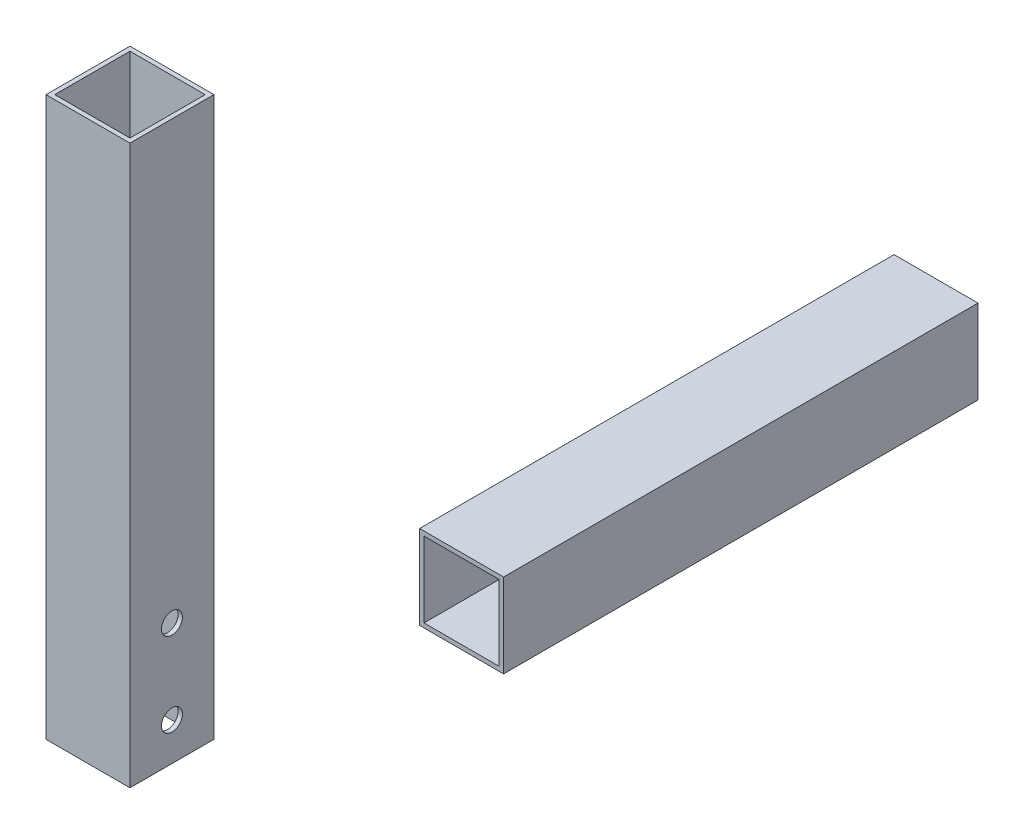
ISO-10303-21;
HEADER;
FILE_DESCRIPTION(('STEP AP214'),'2;1');
FILE_NAME('part.step','',(''),(''),'','','');
FILE_SCHEMA(('AUTOMOTIVE_DESIGN { 1 0 10303 214 1 1 1 1 }'));
ENDSEC;
DATA;
#1=APPLICATION_CONTEXT('core data for automotive mechanical design processes');
#2=APPLICATION_PROTOCOL_DEFINITION('international standard','automotive_design',2000,#1);
#3=PRODUCT_CONTEXT('',#1,'mechanical');
#4=PRODUCT('Part','Part','',(#3));
#5=PRODUCT_RELATED_PRODUCT_CATEGORY('part','',(#4));
#6=PRODUCT_DEFINITION_FORMATION('','',#4);
#7=PRODUCT_DEFINITION_CONTEXT('part definition',#1,'design');
#8=PRODUCT_DEFINITION('design','',#6,#7);
#9=PRODUCT_DEFINITION_SHAPE('','',#8);
#10=(LENGTH_UNIT() NAMED_UNIT(*) SI_UNIT(.MILLI.,.METRE.));
#11=(NAMED_UNIT(*) PLANE_ANGLE_UNIT() SI_UNIT($,.RADIAN.));
#12=(NAMED_UNIT(*) SI_UNIT($,.STERADIAN.) SOLID_ANGLE_UNIT());
#13=UNCERTAINTY_MEASURE_WITH_UNIT(LENGTH_MEASURE(1.E-05),#10,'distance_accuracy_value','');
#14=(GEOMETRIC_REPRESENTATION_CONTEXT(3) GLOBAL_UNCERTAINTY_ASSIGNED_CONTEXT((#13)) GLOBAL_UNIT_ASSIGNED_CONTEXT((#10,
#11,#12)) REPRESENTATION_CONTEXT('',''));
#15=CARTESIAN_POINT('',(0.,0.,0.));
#16=DIRECTION('',(0.,0.,1.));
#17=DIRECTION('',(1.,0.,0.));
#18=AXIS2_PLACEMENT_3D('',#15,#16,#17);
#19=CARTESIAN_POINT('',(-21.59,31.75,0.));
#20=DIRECTION('',(1.,0.,0.));
#21=DIRECTION('',(0.,0.,1.));
#22=AXIS2_PLACEMENT_3D('',#19,#20,#21);
#23=CYLINDRICAL_SURFACE('',#22,3.96875);
#24=DIRECTION('',(1.,0.,0.));
#25=VECTOR('',#24,1.);
#26=CARTESIAN_POINT('',(-21.59,31.75,3.96875));
#27=LINE('',#26,#25);
#28=CARTESIAN_POINT('',(14.224,31.75,3.96875));
#29=VERTEX_POINT('',#28);
#30=CARTESIAN_POINT('',(15.875,31.75,3.96875));
#31=VERTEX_POINT('',#30);
#32=EDGE_CURVE('P0_E11',#29,#31,#27,.T.);
#33=ORIENTED_EDGE('',*,*,#32,.F.);
#34=CARTESIAN_POINT('',(14.224,31.75,0.));
#35=DIRECTION('',(1.,0.,0.));
#36=DIRECTION('',(0.,0.,1.));
#37=AXIS2_PLACEMENT_3D('',#34,#35,#36);
#38=CIRCLE('',#37,3.96875);
#39=EDGE_CURVE('P0_E238',#29,#29,#38,.T.);
#40=ORIENTED_EDGE('',*,*,#39,.F.);
#41=ORIENTED_EDGE('',*,*,#32,.T.);
#42=CARTESIAN_POINT('',(15.875,31.75,0.));
#43=DIRECTION('',(1.,0.,0.));
#44=DIRECTION('',(0.,0.,1.));
#45=AXIS2_PLACEMENT_3D('',#42,#43,#44);
#46=CIRCLE('',#45,3.96875);
#47=EDGE_CURVE('P0_E181',#31,#31,#46,.T.);
#48=ORIENTED_EDGE('',*,*,#47,.T.);
#49=EDGE_LOOP('',(#33,#40,#41,#48));
#50=FACE_BOUND('',#49,.T.);
#51=ADVANCED_FACE('P0_F17',(#50),#23,.F.);
#52=CARTESIAN_POINT('',(-21.59,63.5,0.));
#53=DIRECTION('',(1.,0.,0.));
#54=DIRECTION('',(0.,0.,1.));
#55=AXIS2_PLACEMENT_3D('',#52,#53,#54);
#56=CYLINDRICAL_SURFACE('',#55,3.96875);
#57=DIRECTION('',(1.,0.,0.));
#58=VECTOR('',#57,1.);
#59=CARTESIAN_POINT('',(-21.59,63.5,3.96875));
#60=LINE('',#59,#58);
#61=CARTESIAN_POINT('',(14.224,63.5,3.96875));
#62=VERTEX_POINT('',#61);
#63=CARTESIAN_POINT('',(15.875,63.5,3.96875));
#64=VERTEX_POINT('',#63);
#65=EDGE_CURVE('P0_E27',#62,#64,#60,.T.);
#66=ORIENTED_EDGE('',*,*,#65,.F.);
#67=CARTESIAN_POINT('',(14.224,63.5,0.));
#68=DIRECTION('',(1.,0.,0.));
#69=DIRECTION('',(0.,0.,1.));
#70=AXIS2_PLACEMENT_3D('',#67,#68,#69);
#71=CIRCLE('',#70,3.96875);
#72=EDGE_CURVE('P0_E233',#62,#62,#71,.T.);
#73=ORIENTED_EDGE('',*,*,#72,.F.);
#74=ORIENTED_EDGE('',*,*,#65,.T.);
#75=CARTESIAN_POINT('',(15.875,63.5,0.));
#76=DIRECTION('',(1.,0.,0.));
#77=DIRECTION('',(0.,0.,1.));
#78=AXIS2_PLACEMENT_3D('',#75,#76,#77);
#79=CIRCLE('',#78,3.96875);
#80=EDGE_CURVE('P0_E178',#64,#64,#79,.T.);
#81=ORIENTED_EDGE('',*,*,#80,.T.);
#82=EDGE_LOOP('',(#66,#73,#74,#81));
#83=FACE_BOUND('',#82,.T.);
#84=ADVANCED_FACE('P0_F19',(#83),#56,.F.);
#85=CARTESIAN_POINT('',(-14.224,-7.9375,-14.224));
#86=DIRECTION('',(1.,0.,0.));
#87=DIRECTION('',(0.,1.,0.));
#88=AXIS2_PLACEMENT_3D('',#85,#86,#87);
#89=PLANE('',#88);
#90=CARTESIAN_POINT('',(-14.224,31.75,0.));
#91=DIRECTION('',(1.,0.,0.));
#92=DIRECTION('',(0.,0.,1.));
#93=AXIS2_PLACEMENT_3D('',#90,#91,#92);
#94=CIRCLE('',#93,3.96875);
#95=CARTESIAN_POINT('',(-14.224,31.75,3.96875));
#96=VERTEX_POINT('',#95);
#97=EDGE_CURVE('P0_E183',#96,#96,#94,.T.);
#98=ORIENTED_EDGE('',*,*,#97,.F.);
#99=EDGE_LOOP('',(#98));
#100=FACE_BOUND('',#99,.T.);
#101=CARTESIAN_POINT('',(-14.224,63.5,0.));
#102=DIRECTION('',(1.,0.,0.));
#103=DIRECTION('',(0.,0.,1.));
#104=AXIS2_PLACEMENT_3D('',#101,#102,#103);
#105=CIRCLE('',#104,3.96875);
#106=CARTESIAN_POINT('',(-14.224,63.5,3.96875));
#107=VERTEX_POINT('',#106);
#108=EDGE_CURVE('P0_E220',#107,#107,#105,.T.);
#109=ORIENTED_EDGE('',*,*,#108,.F.);
#110=EDGE_LOOP('',(#109));
#111=FACE_BOUND('',#110,.T.);
#112=DIRECTION('',(0.,1.,0.));
#113=VECTOR('',#112,1.);
#114=CARTESIAN_POINT('',(-14.224,-7.9375,14.224));
#115=LINE('',#114,#113);
#116=CARTESIAN_POINT('',(-14.224,17.4625,14.224));
#117=VERTEX_POINT('',#116);
#118=CARTESIAN_POINT('',(-14.224,228.6,14.224));
#119=VERTEX_POINT('',#118);
#120=EDGE_CURVE('P0_E228',#117,#119,#115,.T.);
#121=ORIENTED_EDGE('',*,*,#120,.F.);
#122=DIRECTION('',(0.,0.,-1.));
#123=VECTOR('',#122,1.);
#124=CARTESIAN_POINT('',(-14.224,17.4625,-15.0495));
#125=LINE('',#124,#123);
#126=CARTESIAN_POINT('',(-14.224,17.4625,-14.224));
#127=VERTEX_POINT('',#126);
#128=EDGE_CURVE('P0_E184',#117,#127,#125,.T.);
#129=ORIENTED_EDGE('',*,*,#128,.T.);
#130=DIRECTION('',(0.,1.,0.));
#131=VECTOR('',#130,1.);
#132=CARTESIAN_POINT('',(-14.224,-7.9375,-14.224));
#133=LINE('',#132,#131);
#134=CARTESIAN_POINT('',(-14.224,228.6,-14.224));
#135=VERTEX_POINT('',#134);
#136=EDGE_CURVE('P0_E241',#127,#135,#133,.T.);
#137=ORIENTED_EDGE('',*,*,#136,.T.);
#138=DIRECTION('',(0.,0.,-1.));
#139=VECTOR('',#138,1.);
#140=CARTESIAN_POINT('',(-14.224,228.6,-15.0495));
#141=LINE('',#140,#139);
#142=EDGE_CURVE('P0_E203',#119,#135,#141,.T.);
#143=ORIENTED_EDGE('',*,*,#142,.F.);
#144=EDGE_LOOP('',(#121,#129,#137,#143));
#145=FACE_BOUND('',#144,.T.);
#146=ADVANCED_FACE('P0_F293',(#100,#111,#145),#89,.T.);
#147=CARTESIAN_POINT('',(-14.224,-7.9375,-14.224));
#148=DIRECTION('',(0.,0.,1.));
#149=DIRECTION('',(1.,0.,0.));
#150=AXIS2_PLACEMENT_3D('',#147,#148,#149);
#151=PLANE('',#150);
#152=ORIENTED_EDGE('',*,*,#136,.F.);
#153=DIRECTION('',(1.,0.,0.));
#154=VECTOR('',#153,1.);
#155=CARTESIAN_POINT('',(-15.0495,17.4625,-14.224));
#156=LINE('',#155,#154);
#157=CARTESIAN_POINT('',(14.224,17.4625,-14.224));
#158=VERTEX_POINT('',#157);
#159=EDGE_CURVE('P0_E180',#127,#158,#156,.T.);
#160=ORIENTED_EDGE('',*,*,#159,.T.);
#161=DIRECTION('',(0.,1.,0.));
#162=VECTOR('',#161,1.);
#163=CARTESIAN_POINT('',(14.224,-7.9375,-14.224));
#164=LINE('',#163,#162);
#165=CARTESIAN_POINT('',(14.224,228.6,-14.224));
#166=VERTEX_POINT('',#165);
#167=EDGE_CURVE('P0_E235',#158,#166,#164,.T.);
#168=ORIENTED_EDGE('',*,*,#167,.T.);
#169=DIRECTION('',(1.,0.,0.));
#170=VECTOR('',#169,1.);
#171=CARTESIAN_POINT('',(-15.0495,228.6,-14.224));
#172=LINE('',#171,#170);
#173=EDGE_CURVE('P0_E202',#135,#166,#172,.T.);
#174=ORIENTED_EDGE('',*,*,#173,.F.);
#175=EDGE_LOOP('',(#152,#160,#168,#174));
#176=FACE_BOUND('',#175,.T.);
#177=ADVANCED_FACE('P0_F253',(#176),#151,.T.);
#178=CARTESIAN_POINT('',(14.224,-7.9375,-14.224));
#179=DIRECTION('',(1.,0.,0.));
#180=DIRECTION('',(0.,1.,0.));
#181=AXIS2_PLACEMENT_3D('',#178,#179,#180);
#182=PLANE('',#181);
#183=ORIENTED_EDGE('',*,*,#39,.T.);
#184=EDGE_LOOP('',(#183));
#185=FACE_BOUND('',#184,.T.);
#186=ORIENTED_EDGE('',*,*,#72,.T.);
#187=EDGE_LOOP('',(#186));
#188=FACE_BOUND('',#187,.T.);
#189=DIRECTION('',(0.,0.,-1.));
#190=VECTOR('',#189,1.);
#191=CARTESIAN_POINT('',(14.224,228.6,-15.0495));
#192=LINE('',#191,#190);
#193=CARTESIAN_POINT('',(14.224,228.6,14.224));
#194=VERTEX_POINT('',#193);
#195=EDGE_CURVE('P0_E207',#194,#166,#192,.T.);
#196=ORIENTED_EDGE('',*,*,#195,.T.);
#197=ORIENTED_EDGE('',*,*,#167,.F.);
#198=DIRECTION('',(0.,0.,-1.));
#199=VECTOR('',#198,1.);
#200=CARTESIAN_POINT('',(14.224,17.4625,-15.0495));
#201=LINE('',#200,#199);
#202=CARTESIAN_POINT('',(14.224,17.4625,14.224));
#203=VERTEX_POINT('',#202);
#204=EDGE_CURVE('P0_E156',#203,#158,#201,.T.);
#205=ORIENTED_EDGE('',*,*,#204,.F.);
#206=DIRECTION('',(0.,1.,0.));
#207=VECTOR('',#206,1.);
#208=CARTESIAN_POINT('',(14.224,-7.9375,14.224));
#209=LINE('',#208,#207);
#210=EDGE_CURVE('P0_E226',#203,#194,#209,.T.);
#211=ORIENTED_EDGE('',*,*,#210,.T.);
#212=EDGE_LOOP('',(#196,#197,#205,#211));
#213=FACE_BOUND('',#212,.T.);
#214=ADVANCED_FACE('P0_F250',(#185,#188,#213),#182,.F.);
#215=CARTESIAN_POINT('',(-14.224,-7.9375,14.224));
#216=DIRECTION('',(0.,0.,1.));
#217=DIRECTION('',(1.,0.,0.));
#218=AXIS2_PLACEMENT_3D('',#215,#216,#217);
#219=PLANE('',#218);
#220=DIRECTION('',(1.,0.,0.));
#221=VECTOR('',#220,1.);
#222=CARTESIAN_POINT('',(-15.0495,228.6,14.224));
#223=LINE('',#222,#221);
#224=EDGE_CURVE('P0_E199',#119,#194,#223,.T.);
#225=ORIENTED_EDGE('',*,*,#224,.T.);
#226=ORIENTED_EDGE('',*,*,#210,.F.);
#227=DIRECTION('',(1.,0.,0.));
#228=VECTOR('',#227,1.);
#229=CARTESIAN_POINT('',(-15.0495,17.4625,14.224));
#230=LINE('',#229,#228);
#231=EDGE_CURVE('P0_E188',#117,#203,#230,.T.);
#232=ORIENTED_EDGE('',*,*,#231,.F.);
#233=ORIENTED_EDGE('',*,*,#120,.T.);
#234=EDGE_LOOP('',(#225,#226,#232,#233));
#235=FACE_BOUND('',#234,.T.);
#236=ADVANCED_FACE('P0_F249',(#235),#219,.F.);
#237=CARTESIAN_POINT('',(15.875,17.4625,-15.875));
#238=DIRECTION('',(1.,0.,0.));
#239=DIRECTION('',(0.,1.,0.));
#240=AXIS2_PLACEMENT_3D('',#237,#238,#239);
#241=PLANE('',#240);
#242=ORIENTED_EDGE('',*,*,#47,.F.);
#243=EDGE_LOOP('',(#242));
#244=FACE_BOUND('',#243,.T.);
#245=ORIENTED_EDGE('',*,*,#80,.F.);
#246=EDGE_LOOP('',(#245));
#247=FACE_BOUND('',#246,.T.);
#248=DIRECTION('',(0.,0.,1.));
#249=VECTOR('',#248,1.);
#250=CARTESIAN_POINT('',(15.875,17.4625,-15.875));
#251=LINE('',#250,#249);
#252=CARTESIAN_POINT('',(15.875,17.4625,-15.875));
#253=VERTEX_POINT('',#252);
#254=CARTESIAN_POINT('',(15.875,17.4625,15.875));
#255=VERTEX_POINT('',#254);
#256=EDGE_CURVE('P0_E151',#253,#255,#251,.T.);
#257=ORIENTED_EDGE('',*,*,#256,.F.);
#258=DIRECTION('',(0.,1.,0.));
#259=VECTOR('',#258,1.);
#260=CARTESIAN_POINT('',(15.875,17.4625,-15.875));
#261=LINE('',#260,#259);
#262=CARTESIAN_POINT('',(15.875,228.6,-15.875));
#263=VERTEX_POINT('',#262);
#264=EDGE_CURVE('P0_E136',#253,#263,#261,.T.);
#265=ORIENTED_EDGE('',*,*,#264,.T.);
#266=DIRECTION('',(0.,0.,1.));
#267=VECTOR('',#266,1.);
#268=CARTESIAN_POINT('',(15.875,228.6,-15.875));
#269=LINE('',#268,#267);
#270=CARTESIAN_POINT('',(15.875,228.6,15.875));
#271=VERTEX_POINT('',#270);
#272=EDGE_CURVE('P0_E148',#263,#271,#269,.T.);
#273=ORIENTED_EDGE('',*,*,#272,.T.);
#274=DIRECTION('',(0.,1.,0.));
#275=VECTOR('',#274,1.);
#276=CARTESIAN_POINT('',(15.875,17.4625,15.875));
#277=LINE('',#276,#275);
#278=EDGE_CURVE('P0_E161',#255,#271,#277,.T.);
#279=ORIENTED_EDGE('',*,*,#278,.F.);
#280=EDGE_LOOP('',(#257,#265,#273,#279));
#281=FACE_BOUND('',#280,.T.);
#282=ADVANCED_FACE('P0_F157',(#244,#247,#281),#241,.T.);
#283=CARTESIAN_POINT('',(-21.59,31.75,0.));
#284=DIRECTION('',(1.,0.,0.));
#285=DIRECTION('',(0.,0.,1.));
#286=AXIS2_PLACEMENT_3D('',#283,#284,#285);
#287=CYLINDRICAL_SURFACE('',#286,3.96875);
#288=DIRECTION('',(1.,0.,0.));
#289=VECTOR('',#288,1.);
#290=CARTESIAN_POINT('',(-21.59,31.75,3.96875));
#291=LINE('',#290,#289);
#292=CARTESIAN_POINT('',(-15.875,31.75,3.96875));
#293=VERTEX_POINT('',#292);
#294=EDGE_CURVE('P0_E219',#293,#96,#291,.T.);
#295=ORIENTED_EDGE('',*,*,#294,.F.);
#296=CARTESIAN_POINT('',(-15.875,31.75,0.));
#297=DIRECTION('',(1.,0.,0.));
#298=DIRECTION('',(0.,0.,1.));
#299=AXIS2_PLACEMENT_3D('',#296,#297,#298);
#300=CIRCLE('',#299,3.96875);
#301=EDGE_CURVE('P0_E163',#293,#293,#300,.T.);
#302=ORIENTED_EDGE('',*,*,#301,.F.);
#303=ORIENTED_EDGE('',*,*,#294,.T.);
#304=ORIENTED_EDGE('',*,*,#97,.T.);
#305=EDGE_LOOP('',(#295,#302,#303,#304));
#306=FACE_BOUND('',#305,.T.);
#307=ADVANCED_FACE('P0_F288',(#306),#287,.F.);
#308=CARTESIAN_POINT('',(-21.59,63.5,0.));
#309=DIRECTION('',(1.,0.,0.));
#310=DIRECTION('',(0.,0.,1.));
#311=AXIS2_PLACEMENT_3D('',#308,#309,#310);
#312=CYLINDRICAL_SURFACE('',#311,3.96875);
#313=DIRECTION('',(1.,0.,0.));
#314=VECTOR('',#313,1.);
#315=CARTESIAN_POINT('',(-21.59,63.5,3.96875));
#316=LINE('',#315,#314);
#317=CARTESIAN_POINT('',(-15.875,63.5,3.96875));
#318=VERTEX_POINT('',#317);
#319=EDGE_CURVE('P0_E213',#318,#107,#316,.T.);
#320=ORIENTED_EDGE('',*,*,#319,.F.);
#321=CARTESIAN_POINT('',(-15.875,63.5,0.));
#322=DIRECTION('',(1.,0.,0.));
#323=DIRECTION('',(0.,0.,1.));
#324=AXIS2_PLACEMENT_3D('',#321,#322,#323);
#325=CIRCLE('',#324,3.96875);
#326=EDGE_CURVE('P0_E174',#318,#318,#325,.T.);
#327=ORIENTED_EDGE('',*,*,#326,.F.);
#328=ORIENTED_EDGE('',*,*,#319,.T.);
#329=ORIENTED_EDGE('',*,*,#108,.T.);
#330=EDGE_LOOP('',(#320,#327,#328,#329));
#331=FACE_BOUND('',#330,.T.);
#332=ADVANCED_FACE('P0_F299',(#331),#312,.F.);
#333=CARTESIAN_POINT('',(-15.875,228.6,-15.875));
#334=DIRECTION('',(0.,1.,0.));
#335=DIRECTION('',(1.,0.,0.));
#336=AXIS2_PLACEMENT_3D('',#333,#334,#335);
#337=PLANE('',#336);
#338=ORIENTED_EDGE('',*,*,#224,.F.);
#339=ORIENTED_EDGE('',*,*,#142,.T.);
#340=ORIENTED_EDGE('',*,*,#173,.T.);
#341=ORIENTED_EDGE('',*,*,#195,.F.);
#342=EDGE_LOOP('',(#338,#339,#340,#341));
#343=FACE_BOUND('',#342,.T.);
#344=DIRECTION('',(1.,0.,0.));
#345=VECTOR('',#344,1.);
#346=CARTESIAN_POINT('',(-15.875,228.6,-15.875));
#347=LINE('',#346,#345);
#348=CARTESIAN_POINT('',(-15.875,228.6,-15.875));
#349=VERTEX_POINT('',#348);
#350=EDGE_CURVE('P0_E142',#349,#263,#347,.T.);
#351=ORIENTED_EDGE('',*,*,#350,.F.);
#352=DIRECTION('',(0.,0.,1.));
#353=VECTOR('',#352,1.);
#354=CARTESIAN_POINT('',(-15.875,228.6,-15.875));
#355=LINE('',#354,#353);
#356=CARTESIAN_POINT('',(-15.875,228.6,15.875));
#357=VERTEX_POINT('',#356);
#358=EDGE_CURVE('P0_E278',#349,#357,#355,.T.);
#359=ORIENTED_EDGE('',*,*,#358,.T.);
#360=DIRECTION('',(1.,0.,0.));
#361=VECTOR('',#360,1.);
#362=CARTESIAN_POINT('',(-15.875,228.6,15.875));
#363=LINE('',#362,#361);
#364=EDGE_CURVE('P0_E194',#357,#271,#363,.T.);
#365=ORIENTED_EDGE('',*,*,#364,.T.);
#366=ORIENTED_EDGE('',*,*,#272,.F.);
#367=EDGE_LOOP('',(#351,#359,#365,#366));
#368=FACE_BOUND('',#367,.T.);
#369=ADVANCED_FACE('P0_F261',(#343,#368),#337,.T.);
#370=CARTESIAN_POINT('',(-15.875,17.4625,-15.875));
#371=DIRECTION('',(0.,0.,1.));
#372=DIRECTION('',(1.,0.,0.));
#373=AXIS2_PLACEMENT_3D('',#370,#371,#372);
#374=PLANE('',#373);
#375=ORIENTED_EDGE('',*,*,#350,.T.);
#376=ORIENTED_EDGE('',*,*,#264,.F.);
#377=DIRECTION('',(1.,0.,0.));
#378=VECTOR('',#377,1.);
#379=CARTESIAN_POINT('',(-15.875,17.4625,-15.875));
#380=LINE('',#379,#378);
#381=CARTESIAN_POINT('',(-15.875,17.4625,-15.875));
#382=VERTEX_POINT('',#381);
#383=EDGE_CURVE('P0_E139',#382,#253,#380,.T.);
#384=ORIENTED_EDGE('',*,*,#383,.F.);
#385=DIRECTION('',(0.,1.,0.));
#386=VECTOR('',#385,1.);
#387=CARTESIAN_POINT('',(-15.875,17.4625,-15.875));
#388=LINE('',#387,#386);
#389=EDGE_CURVE('P0_E279',#382,#349,#388,.T.);
#390=ORIENTED_EDGE('',*,*,#389,.T.);
#391=EDGE_LOOP('',(#375,#376,#384,#390));
#392=FACE_BOUND('',#391,.T.);
#393=ADVANCED_FACE('P0_F138',(#392),#374,.F.);
#394=CARTESIAN_POINT('',(-15.875,17.4625,15.875));
#395=DIRECTION('',(0.,0.,1.));
#396=DIRECTION('',(1.,0.,0.));
#397=AXIS2_PLACEMENT_3D('',#394,#395,#396);
#398=PLANE('',#397);
#399=DIRECTION('',(0.,1.,0.));
#400=VECTOR('',#399,1.);
#401=CARTESIAN_POINT('',(-15.875,17.4625,15.875));
#402=LINE('',#401,#400);
#403=CARTESIAN_POINT('',(-15.875,17.4625,15.875));
#404=VERTEX_POINT('',#403);
#405=EDGE_CURVE('P0_E309',#404,#357,#402,.T.);
#406=ORIENTED_EDGE('',*,*,#405,.F.);
#407=DIRECTION('',(1.,0.,0.));
#408=VECTOR('',#407,1.);
#409=CARTESIAN_POINT('',(-15.875,17.4625,15.875));
#410=LINE('',#409,#408);
#411=EDGE_CURVE('P0_E160',#404,#255,#410,.T.);
#412=ORIENTED_EDGE('',*,*,#411,.T.);
#413=ORIENTED_EDGE('',*,*,#278,.T.);
#414=ORIENTED_EDGE('',*,*,#364,.F.);
#415=EDGE_LOOP('',(#406,#412,#413,#414));
#416=FACE_BOUND('',#415,.T.);
#417=ADVANCED_FACE('P0_F317',(#416),#398,.T.);
#418=CARTESIAN_POINT('',(-15.875,17.4625,-15.875));
#419=DIRECTION('',(0.,1.,0.));
#420=DIRECTION('',(1.,0.,0.));
#421=AXIS2_PLACEMENT_3D('',#418,#419,#420);
#422=PLANE('',#421);
#423=ORIENTED_EDGE('',*,*,#204,.T.);
#424=ORIENTED_EDGE('',*,*,#159,.F.);
#425=ORIENTED_EDGE('',*,*,#128,.F.);
#426=ORIENTED_EDGE('',*,*,#231,.T.);
#427=EDGE_LOOP('',(#423,#424,#425,#426));
#428=FACE_BOUND('',#427,.T.);
#429=ORIENTED_EDGE('',*,*,#256,.T.);
#430=ORIENTED_EDGE('',*,*,#411,.F.);
#431=DIRECTION('',(0.,0.,1.));
#432=VECTOR('',#431,1.);
#433=CARTESIAN_POINT('',(-15.875,17.4625,-15.875));
#434=LINE('',#433,#432);
#435=EDGE_CURVE('P0_E153',#382,#404,#434,.T.);
#436=ORIENTED_EDGE('',*,*,#435,.F.);
#437=ORIENTED_EDGE('',*,*,#383,.T.);
#438=EDGE_LOOP('',(#429,#430,#436,#437));
#439=FACE_BOUND('',#438,.T.);
#440=ADVANCED_FACE('P0_F147',(#428,#439),#422,.F.);
#441=CARTESIAN_POINT('',(-15.875,17.4625,-15.875));
#442=DIRECTION('',(1.,0.,0.));
#443=DIRECTION('',(0.,1.,0.));
#444=AXIS2_PLACEMENT_3D('',#441,#442,#443);
#445=PLANE('',#444);
#446=ORIENTED_EDGE('',*,*,#301,.T.);
#447=EDGE_LOOP('',(#446));
#448=FACE_BOUND('',#447,.T.);
#449=ORIENTED_EDGE('',*,*,#326,.T.);
#450=EDGE_LOOP('',(#449));
#451=FACE_BOUND('',#450,.T.);
#452=ORIENTED_EDGE('',*,*,#405,.T.);
#453=ORIENTED_EDGE('',*,*,#358,.F.);
#454=ORIENTED_EDGE('',*,*,#389,.F.);
#455=ORIENTED_EDGE('',*,*,#435,.T.);
#456=EDGE_LOOP('',(#452,#453,#454,#455));
#457=FACE_BOUND('',#456,.T.);
#458=ADVANCED_FACE('P0_F305',(#448,#451,#457),#445,.F.);
#459=CLOSED_SHELL('',(#51,#84,#146,#177,#214,#236,#282,#307,#332,#369,#393,#417,#440,#458));
#460=MANIFOLD_SOLID_BREP('P0_B1',#459);
#461=CARTESIAN_POINT('',(-14.224,-14.224,-330.2));
#462=DIRECTION('',(1.,0.,0.));
#463=DIRECTION('',(0.,1.,0.));
#464=AXIS2_PLACEMENT_3D('',#461,#462,#463);
#465=PLANE('',#464);
#466=DIRECTION('',(0.,0.,1.));
#467=VECTOR('',#466,1.);
#468=CARTESIAN_POINT('',(-14.224,-14.224,-330.2));
#469=LINE('',#468,#467);
#470=CARTESIAN_POINT('',(-14.224,-14.224,-304.8));
#471=VERTEX_POINT('',#470);
#472=CARTESIAN_POINT('',(-14.224,-14.224,-125.4125));
#473=VERTEX_POINT('',#472);
#474=EDGE_CURVE('P1_E39',#471,#473,#469,.T.);
#475=ORIENTED_EDGE('',*,*,#474,.F.);
#476=DIRECTION('',(0.,1.,0.));
#477=VECTOR('',#476,1.);
#478=CARTESIAN_POINT('',(-14.224,-15.0495,-304.8));
#479=LINE('',#478,#477);
#480=CARTESIAN_POINT('',(-14.224,14.224,-304.8));
#481=VERTEX_POINT('',#480);
#482=EDGE_CURVE('P1_E160',#471,#481,#479,.T.);
#483=ORIENTED_EDGE('',*,*,#482,.T.);
#484=DIRECTION('',(0.,0.,1.));
#485=VECTOR('',#484,1.);
#486=CARTESIAN_POINT('',(-14.224,14.224,-330.2));
#487=LINE('',#486,#485);
#488=CARTESIAN_POINT('',(-14.224,14.224,-125.4125));
#489=VERTEX_POINT('',#488);
#490=EDGE_CURVE('P1_E10',#481,#489,#487,.T.);
#491=ORIENTED_EDGE('',*,*,#490,.T.);
#492=DIRECTION('',(0.,1.,0.));
#493=VECTOR('',#492,1.);
#494=CARTESIAN_POINT('',(-14.224,-15.0495,-125.4125));
#495=LINE('',#494,#493);
#496=EDGE_CURVE('P1_E153',#473,#489,#495,.T.);
#497=ORIENTED_EDGE('',*,*,#496,.F.);
#498=EDGE_LOOP('',(#475,#483,#491,#497));
#499=FACE_BOUND('',#498,.T.);
#500=ADVANCED_FACE('P1_F16',(#499),#465,.T.);
#501=CARTESIAN_POINT('',(-14.224,14.224,-330.2));
#502=DIRECTION('',(0.,1.,0.));
#503=DIRECTION('',(1.,0.,0.));
#504=AXIS2_PLACEMENT_3D('',#501,#502,#503);
#505=PLANE('',#504);
#506=DIRECTION('',(-1.,0.,0.));
#507=VECTOR('',#506,1.);
#508=CARTESIAN_POINT('',(-15.0495,14.224,-125.4125));
#509=LINE('',#508,#507);
#510=CARTESIAN_POINT('',(14.224,14.224,-125.4125));
#511=VERTEX_POINT('',#510);
#512=EDGE_CURVE('P1_E132',#511,#489,#509,.T.);
#513=ORIENTED_EDGE('',*,*,#512,.T.);
#514=ORIENTED_EDGE('',*,*,#490,.F.);
#515=DIRECTION('',(-1.,0.,0.));
#516=VECTOR('',#515,1.);
#517=CARTESIAN_POINT('',(-15.0495,14.224,-304.8));
#518=LINE('',#517,#516);
#519=CARTESIAN_POINT('',(14.224,14.224,-304.8));
#520=VERTEX_POINT('',#519);
#521=EDGE_CURVE('P1_E161',#520,#481,#518,.T.);
#522=ORIENTED_EDGE('',*,*,#521,.F.);
#523=DIRECTION('',(0.,0.,1.));
#524=VECTOR('',#523,1.);
#525=CARTESIAN_POINT('',(14.224,14.224,-330.2));
#526=LINE('',#525,#524);
#527=EDGE_CURVE('P1_E27',#520,#511,#526,.T.);
#528=ORIENTED_EDGE('',*,*,#527,.T.);
#529=EDGE_LOOP('',(#513,#514,#522,#528));
#530=FACE_BOUND('',#529,.T.);
#531=ADVANCED_FACE('P1_F191',(#530),#505,.F.);
#532=CARTESIAN_POINT('',(14.224,-14.224,-330.2));
#533=DIRECTION('',(1.,0.,0.));
#534=DIRECTION('',(0.,1.,0.));
#535=AXIS2_PLACEMENT_3D('',#532,#533,#534);
#536=PLANE('',#535);
#537=DIRECTION('',(0.,1.,0.));
#538=VECTOR('',#537,1.);
#539=CARTESIAN_POINT('',(14.224,-15.0495,-125.4125));
#540=LINE('',#539,#538);
#541=CARTESIAN_POINT('',(14.224,-14.224,-125.4125));
#542=VERTEX_POINT('',#541);
#543=EDGE_CURVE('P1_E126',#542,#511,#540,.T.);
#544=ORIENTED_EDGE('',*,*,#543,.T.);
#545=ORIENTED_EDGE('',*,*,#527,.F.);
#546=DIRECTION('',(0.,1.,0.));
#547=VECTOR('',#546,1.);
#548=CARTESIAN_POINT('',(14.224,-15.0495,-304.8));
#549=LINE('',#548,#547);
#550=CARTESIAN_POINT('',(14.224,-14.224,-304.8));
#551=VERTEX_POINT('',#550);
#552=EDGE_CURVE('P1_E112',#551,#520,#549,.T.);
#553=ORIENTED_EDGE('',*,*,#552,.F.);
#554=DIRECTION('',(0.,0.,1.));
#555=VECTOR('',#554,1.);
#556=CARTESIAN_POINT('',(14.224,-14.224,-330.2));
#557=LINE('',#556,#555);
#558=EDGE_CURVE('P1_E172',#551,#542,#557,.T.);
#559=ORIENTED_EDGE('',*,*,#558,.T.);
#560=EDGE_LOOP('',(#544,#545,#553,#559));
#561=FACE_BOUND('',#560,.T.);
#562=ADVANCED_FACE('P1_F18',(#561),#536,.F.);
#563=CARTESIAN_POINT('',(-14.224,-14.224,-330.2));
#564=DIRECTION('',(0.,1.,0.));
#565=DIRECTION('',(1.,0.,0.));
#566=AXIS2_PLACEMENT_3D('',#563,#564,#565);
#567=PLANE('',#566);
#568=ORIENTED_EDGE('',*,*,#558,.F.);
#569=DIRECTION('',(-1.,0.,0.));
#570=VECTOR('',#569,1.);
#571=CARTESIAN_POINT('',(-15.0495,-14.224,-304.8));
#572=LINE('',#571,#570);
#573=EDGE_CURVE('P1_E159',#551,#471,#572,.T.);
#574=ORIENTED_EDGE('',*,*,#573,.T.);
#575=ORIENTED_EDGE('',*,*,#474,.T.);
#576=DIRECTION('',(-1.,0.,0.));
#577=VECTOR('',#576,1.);
#578=CARTESIAN_POINT('',(-15.0495,-14.224,-125.4125));
#579=LINE('',#578,#577);
#580=EDGE_CURVE('P1_E146',#542,#473,#579,.T.);
#581=ORIENTED_EDGE('',*,*,#580,.F.);
#582=EDGE_LOOP('',(#568,#574,#575,#581));
#583=FACE_BOUND('',#582,.T.);
#584=ADVANCED_FACE('P1_F179',(#583),#567,.T.);
#585=CARTESIAN_POINT('',(15.875,-15.875,-304.8));
#586=DIRECTION('',(1.,0.,0.));
#587=DIRECTION('',(0.,1.,0.));
#588=AXIS2_PLACEMENT_3D('',#585,#586,#587);
#589=PLANE('',#588);
#590=DIRECTION('',(0.,0.,1.));
#591=VECTOR('',#590,1.);
#592=CARTESIAN_POINT('',(15.875,-15.875,-304.8));
#593=LINE('',#592,#591);
#594=CARTESIAN_POINT('',(15.875,-15.875,-304.8));
#595=VERTEX_POINT('',#594);
#596=CARTESIAN_POINT('',(15.875,-15.875,-125.4125));
#597=VERTEX_POINT('',#596);
#598=EDGE_CURVE('P1_E106',#595,#597,#593,.T.);
#599=ORIENTED_EDGE('',*,*,#598,.F.);
#600=DIRECTION('',(0.,1.,0.));
#601=VECTOR('',#600,1.);
#602=CARTESIAN_POINT('',(15.875,-15.875,-304.8));
#603=LINE('',#602,#601);
#604=CARTESIAN_POINT('',(15.875,15.875,-304.8));
#605=VERTEX_POINT('',#604);
#606=EDGE_CURVE('P1_E97',#595,#605,#603,.T.);
#607=ORIENTED_EDGE('',*,*,#606,.T.);
#608=DIRECTION('',(0.,0.,1.));
#609=VECTOR('',#608,1.);
#610=CARTESIAN_POINT('',(15.875,15.875,-304.8));
#611=LINE('',#610,#609);
#612=CARTESIAN_POINT('',(15.875,15.875,-125.4125));
#613=VERTEX_POINT('',#612);
#614=EDGE_CURVE('P1_E103',#605,#613,#611,.T.);
#615=ORIENTED_EDGE('',*,*,#614,.T.);
#616=DIRECTION('',(0.,1.,0.));
#617=VECTOR('',#616,1.);
#618=CARTESIAN_POINT('',(15.875,-15.875,-125.4125));
#619=LINE('',#618,#617);
#620=EDGE_CURVE('P1_E141',#597,#613,#619,.T.);
#621=ORIENTED_EDGE('',*,*,#620,.F.);
#622=EDGE_LOOP('',(#599,#607,#615,#621));
#623=FACE_BOUND('',#622,.T.);
#624=ADVANCED_FACE('P1_F101',(#623),#589,.T.);
#625=CARTESIAN_POINT('',(-15.875,-15.875,-304.8));
#626=DIRECTION('',(0.,0.,1.));
#627=DIRECTION('',(1.,0.,0.));
#628=AXIS2_PLACEMENT_3D('',#625,#626,#627);
#629=PLANE('',#628);
#630=ORIENTED_EDGE('',*,*,#552,.T.);
#631=ORIENTED_EDGE('',*,*,#521,.T.);
#632=ORIENTED_EDGE('',*,*,#482,.F.);
#633=ORIENTED_EDGE('',*,*,#573,.F.);
#634=EDGE_LOOP('',(#630,#631,#632,#633));
#635=FACE_BOUND('',#634,.T.);
#636=DIRECTION('',(1.,0.,0.));
#637=VECTOR('',#636,1.);
#638=CARTESIAN_POINT('',(-15.875,15.875,-304.8));
#639=LINE('',#638,#637);
#640=CARTESIAN_POINT('',(-15.875,15.875,-304.8));
#641=VERTEX_POINT('',#640);
#642=EDGE_CURVE('P1_E116',#641,#605,#639,.T.);
#643=ORIENTED_EDGE('',*,*,#642,.T.);
#644=ORIENTED_EDGE('',*,*,#606,.F.);
#645=DIRECTION('',(1.,0.,0.));
#646=VECTOR('',#645,1.);
#647=CARTESIAN_POINT('',(-15.875,-15.875,-304.8));
#648=LINE('',#647,#646);
#649=CARTESIAN_POINT('',(-15.875,-15.875,-304.8));
#650=VERTEX_POINT('',#649);
#651=EDGE_CURVE('P1_E143',#650,#595,#648,.T.);
#652=ORIENTED_EDGE('',*,*,#651,.F.);
#653=DIRECTION('',(0.,1.,0.));
#654=VECTOR('',#653,1.);
#655=CARTESIAN_POINT('',(-15.875,-15.875,-304.8));
#656=LINE('',#655,#654);
#657=EDGE_CURVE('P1_E122',#650,#641,#656,.T.);
#658=ORIENTED_EDGE('',*,*,#657,.T.);
#659=EDGE_LOOP('',(#643,#644,#652,#658));
#660=FACE_BOUND('',#659,.T.);
#661=ADVANCED_FACE('P1_F125',(#635,#660),#629,.F.);
#662=CARTESIAN_POINT('',(-15.875,15.875,-304.8));
#663=DIRECTION('',(0.,1.,0.));
#664=DIRECTION('',(1.,0.,0.));
#665=AXIS2_PLACEMENT_3D('',#662,#663,#664);
#666=PLANE('',#665);
#667=ORIENTED_EDGE('',*,*,#642,.F.);
#668=DIRECTION('',(0.,0.,1.));
#669=VECTOR('',#668,1.);
#670=CARTESIAN_POINT('',(-15.875,15.875,-304.8));
#671=LINE('',#670,#669);
#672=CARTESIAN_POINT('',(-15.875,15.875,-125.4125));
#673=VERTEX_POINT('',#672);
#674=EDGE_CURVE('P1_E283',#641,#673,#671,.T.);
#675=ORIENTED_EDGE('',*,*,#674,.T.);
#676=DIRECTION('',(1.,0.,0.));
#677=VECTOR('',#676,1.);
#678=CARTESIAN_POINT('',(-15.875,15.875,-125.4125));
#679=LINE('',#678,#677);
#680=EDGE_CURVE('P1_E119',#673,#613,#679,.T.);
#681=ORIENTED_EDGE('',*,*,#680,.T.);
#682=ORIENTED_EDGE('',*,*,#614,.F.);
#683=EDGE_LOOP('',(#667,#675,#681,#682));
#684=FACE_BOUND('',#683,.T.);
#685=ADVANCED_FACE('P1_F111',(#684),#666,.T.);
#686=CARTESIAN_POINT('',(-15.875,-15.875,-125.4125));
#687=DIRECTION('',(0.,0.,1.));
#688=DIRECTION('',(1.,0.,0.));
#689=AXIS2_PLACEMENT_3D('',#686,#687,#688);
#690=PLANE('',#689);
#691=ORIENTED_EDGE('',*,*,#580,.T.);
#692=ORIENTED_EDGE('',*,*,#496,.T.);
#693=ORIENTED_EDGE('',*,*,#512,.F.);
#694=ORIENTED_EDGE('',*,*,#543,.F.);
#695=EDGE_LOOP('',(#691,#692,#693,#694));
#696=FACE_BOUND('',#695,.T.);
#697=DIRECTION('',(0.,1.,0.));
#698=VECTOR('',#697,1.);
#699=CARTESIAN_POINT('',(-15.875,-15.875,-125.4125));
#700=LINE('',#699,#698);
#701=CARTESIAN_POINT('',(-15.875,-15.875,-125.4125));
#702=VERTEX_POINT('',#701);
#703=EDGE_CURVE('P1_E282',#702,#673,#700,.T.);
#704=ORIENTED_EDGE('',*,*,#703,.F.);
#705=DIRECTION('',(1.,0.,0.));
#706=VECTOR('',#705,1.);
#707=CARTESIAN_POINT('',(-15.875,-15.875,-125.4125));
#708=LINE('',#707,#706);
#709=EDGE_CURVE('P1_E138',#702,#597,#708,.T.);
#710=ORIENTED_EDGE('',*,*,#709,.T.);
#711=ORIENTED_EDGE('',*,*,#620,.T.);
#712=ORIENTED_EDGE('',*,*,#680,.F.);
#713=EDGE_LOOP('',(#704,#710,#711,#712));
#714=FACE_BOUND('',#713,.T.);
#715=ADVANCED_FACE('P1_F186',(#696,#714),#690,.T.);
#716=CARTESIAN_POINT('',(-15.875,-15.875,-304.8));
#717=DIRECTION('',(0.,1.,0.));
#718=DIRECTION('',(1.,0.,0.));
#719=AXIS2_PLACEMENT_3D('',#716,#717,#718);
#720=PLANE('',#719);
#721=ORIENTED_EDGE('',*,*,#598,.T.);
#722=ORIENTED_EDGE('',*,*,#709,.F.);
#723=DIRECTION('',(0.,0.,1.));
#724=VECTOR('',#723,1.);
#725=CARTESIAN_POINT('',(-15.875,-15.875,-304.8));
#726=LINE('',#725,#724);
#727=EDGE_CURVE('P1_E276',#650,#702,#726,.T.);
#728=ORIENTED_EDGE('',*,*,#727,.F.);
#729=ORIENTED_EDGE('',*,*,#651,.T.);
#730=EDGE_LOOP('',(#721,#722,#728,#729));
#731=FACE_BOUND('',#730,.T.);
#732=ADVANCED_FACE('P1_F201',(#731),#720,.F.);
#733=CARTESIAN_POINT('',(-15.875,-15.875,-304.8));
#734=DIRECTION('',(1.,0.,0.));
#735=DIRECTION('',(0.,1.,0.));
#736=AXIS2_PLACEMENT_3D('',#733,#734,#735);
#737=PLANE('',#736);
#738=ORIENTED_EDGE('',*,*,#703,.T.);
#739=ORIENTED_EDGE('',*,*,#674,.F.);
#740=ORIENTED_EDGE('',*,*,#657,.F.);
#741=ORIENTED_EDGE('',*,*,#727,.T.);
#742=EDGE_LOOP('',(#738,#739,#740,#741));
#743=FACE_BOUND('',#742,.T.);
#744=ADVANCED_FACE('P1_F204',(#743),#737,.F.);
#745=CLOSED_SHELL('',(#500,#531,#562,#584,#624,#661,#685,#715,#732,#744));
#746=MANIFOLD_SOLID_BREP('P1_B1',#745);
#747=ADVANCED_BREP_SHAPE_REPRESENTATION('',(#18,#460,#746),#14);
#748=SHAPE_DEFINITION_REPRESENTATION(#9,#747);
ENDSEC;
END-ISO-10303-21;
